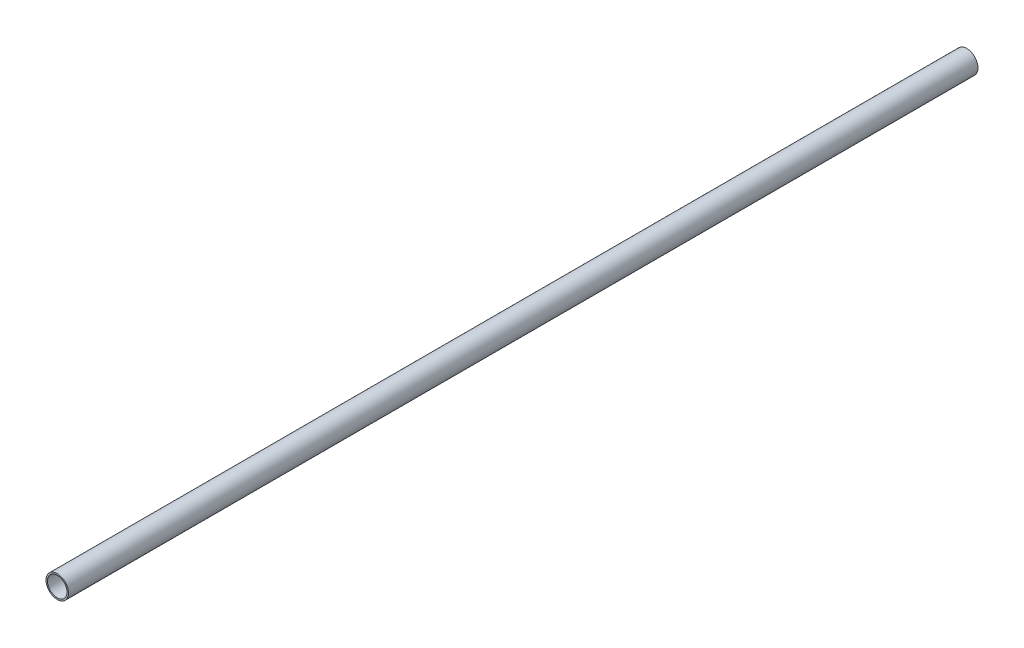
ISO-10303-21;
HEADER;
FILE_DESCRIPTION(('STEP AP214'),'2;1');
FILE_NAME('part.step','',(''),(''),'','','');
FILE_SCHEMA(('AUTOMOTIVE_DESIGN { 1 0 10303 214 1 1 1 1 }'));
ENDSEC;
DATA;
#1=APPLICATION_CONTEXT('core data for automotive mechanical design processes');
#2=APPLICATION_PROTOCOL_DEFINITION('international standard','automotive_design',2000,#1);
#3=PRODUCT_CONTEXT('',#1,'mechanical');
#4=PRODUCT('Part','Part','',(#3));
#5=PRODUCT_RELATED_PRODUCT_CATEGORY('part','',(#4));
#6=PRODUCT_DEFINITION_FORMATION('','',#4);
#7=PRODUCT_DEFINITION_CONTEXT('part definition',#1,'design');
#8=PRODUCT_DEFINITION('design','',#6,#7);
#9=PRODUCT_DEFINITION_SHAPE('','',#8);
#10=(LENGTH_UNIT() NAMED_UNIT(*) SI_UNIT(.MILLI.,.METRE.));
#11=(NAMED_UNIT(*) PLANE_ANGLE_UNIT() SI_UNIT($,.RADIAN.));
#12=(NAMED_UNIT(*) SI_UNIT($,.STERADIAN.) SOLID_ANGLE_UNIT());
#13=UNCERTAINTY_MEASURE_WITH_UNIT(LENGTH_MEASURE(1.E-05),#10,'distance_accuracy_value','');
#14=(GEOMETRIC_REPRESENTATION_CONTEXT(3) GLOBAL_UNCERTAINTY_ASSIGNED_CONTEXT((#13)) GLOBAL_UNIT_ASSIGNED_CONTEXT((#10,
#11,#12)) REPRESENTATION_CONTEXT('',''));
#15=CARTESIAN_POINT('',(0.,0.,0.));
#16=DIRECTION('',(0.,0.,1.));
#17=DIRECTION('',(1.,0.,0.));
#18=AXIS2_PLACEMENT_3D('',#15,#16,#17);
#19=CARTESIAN_POINT('',(0.,0.,2438.4));
#20=DIRECTION('',(0.,0.,1.));
#21=DIRECTION('',(1.,0.,0.));
#22=AXIS2_PLACEMENT_3D('',#19,#20,#21);
#23=PLANE('',#22);
#24=CARTESIAN_POINT('',(0.,0.,2438.4));
#25=DIRECTION('',(0.,0.,1.));
#26=DIRECTION('',(1.,0.,0.));
#27=AXIS2_PLACEMENT_3D('',#24,#25,#26);
#28=CIRCLE('',#27,30.1625);
#29=CARTESIAN_POINT('',(-30.1625,0.,2438.4));
#30=VERTEX_POINT('',#29);
#31=EDGE_CURVE('E10',#30,#30,#28,.T.);
#32=ORIENTED_EDGE('',*,*,#31,.T.);
#33=EDGE_LOOP('',(#32));
#34=FACE_BOUND('',#33,.T.);
#35=CARTESIAN_POINT('',(0.,0.,2438.4));
#36=DIRECTION('',(0.,0.,1.));
#37=DIRECTION('',(1.,0.,0.));
#38=AXIS2_PLACEMENT_3D('',#35,#36,#37);
#39=CIRCLE('',#38,26.2509);
#40=CARTESIAN_POINT('',(-26.2509,0.,2438.4));
#41=VERTEX_POINT('',#40);
#42=EDGE_CURVE('E47',#41,#41,#39,.T.);
#43=ORIENTED_EDGE('',*,*,#42,.F.);
#44=EDGE_LOOP('',(#43));
#45=FACE_BOUND('',#44,.T.);
#46=ADVANCED_FACE('F36',(#34,#45),#23,.T.);
#47=CARTESIAN_POINT('',(0.,0.,0.));
#48=DIRECTION('',(0.,0.,1.));
#49=DIRECTION('',(1.,0.,0.));
#50=AXIS2_PLACEMENT_3D('',#47,#48,#49);
#51=PLANE('',#50);
#52=CARTESIAN_POINT('',(0.,0.,0.));
#53=DIRECTION('',(0.,0.,1.));
#54=DIRECTION('',(1.,0.,0.));
#55=AXIS2_PLACEMENT_3D('',#52,#53,#54);
#56=CIRCLE('',#55,30.1625);
#57=CARTESIAN_POINT('',(-30.1625,0.,0.));
#58=VERTEX_POINT('',#57);
#59=EDGE_CURVE('E43',#58,#58,#56,.T.);
#60=ORIENTED_EDGE('',*,*,#59,.F.);
#61=EDGE_LOOP('',(#60));
#62=FACE_BOUND('',#61,.T.);
#63=CARTESIAN_POINT('',(0.,0.,0.));
#64=DIRECTION('',(0.,0.,1.));
#65=DIRECTION('',(1.,0.,0.));
#66=AXIS2_PLACEMENT_3D('',#63,#64,#65);
#67=CIRCLE('',#66,26.2509);
#68=CARTESIAN_POINT('',(-26.2509,0.,0.));
#69=VERTEX_POINT('',#68);
#70=EDGE_CURVE('E51',#69,#69,#67,.T.);
#71=ORIENTED_EDGE('',*,*,#70,.T.);
#72=EDGE_LOOP('',(#71));
#73=FACE_BOUND('',#72,.T.);
#74=ADVANCED_FACE('F57',(#62,#73),#51,.F.);
#75=CARTESIAN_POINT('',(0.,0.,2438.4));
#76=DIRECTION('',(0.,0.,-1.));
#77=DIRECTION('',(-1.,0.,0.));
#78=AXIS2_PLACEMENT_3D('',#75,#76,#77);
#79=CYLINDRICAL_SURFACE('',#78,30.1625);
#80=CARTESIAN_POINT('',(-30.1625,0.,2438.4));
#81=CARTESIAN_POINT('',(-30.1625,0.,2413.));
#82=CARTESIAN_POINT('',(-30.1625,0.,2387.6));
#83=CARTESIAN_POINT('',(-30.1625,0.,2336.8));
#84=CARTESIAN_POINT('',(-30.1625,0.,2311.4));
#85=CARTESIAN_POINT('',(-30.1625,0.,2260.6));
#86=CARTESIAN_POINT('',(-30.1625,0.,2235.2));
#87=CARTESIAN_POINT('',(-30.1625,0.,2184.4));
#88=CARTESIAN_POINT('',(-30.1625,0.,2159.));
#89=CARTESIAN_POINT('',(-30.1625,0.,2108.2));
#90=CARTESIAN_POINT('',(-30.1625,0.,2082.8));
#91=CARTESIAN_POINT('',(-30.1625,0.,2032.));
#92=CARTESIAN_POINT('',(-30.1625,0.,2006.6));
#93=CARTESIAN_POINT('',(-30.1625,0.,1955.8));
#94=CARTESIAN_POINT('',(-30.1625,0.,1930.4));
#95=CARTESIAN_POINT('',(-30.1625,0.,1879.6));
#96=CARTESIAN_POINT('',(-30.1625,0.,1854.2));
#97=CARTESIAN_POINT('',(-30.1625,0.,1803.4));
#98=CARTESIAN_POINT('',(-30.1625,0.,1778.));
#99=CARTESIAN_POINT('',(-30.1625,0.,1727.2));
#100=CARTESIAN_POINT('',(-30.1625,0.,1701.8));
#101=CARTESIAN_POINT('',(-30.1625,0.,1651.));
#102=CARTESIAN_POINT('',(-30.1625,0.,1625.6));
#103=CARTESIAN_POINT('',(-30.1625,0.,1574.8));
#104=CARTESIAN_POINT('',(-30.1625,0.,1549.4));
#105=CARTESIAN_POINT('',(-30.1625,0.,1498.6));
#106=CARTESIAN_POINT('',(-30.1625,0.,1473.2));
#107=CARTESIAN_POINT('',(-30.1625,0.,1422.4));
#108=CARTESIAN_POINT('',(-30.1625,0.,1397.));
#109=CARTESIAN_POINT('',(-30.1625,0.,1346.2));
#110=CARTESIAN_POINT('',(-30.1625,0.,1320.8));
#111=CARTESIAN_POINT('',(-30.1625,0.,1270.));
#112=CARTESIAN_POINT('',(-30.1625,0.,1244.6));
#113=CARTESIAN_POINT('',(-30.1625,0.,1193.8));
#114=CARTESIAN_POINT('',(-30.1625,0.,1168.4));
#115=CARTESIAN_POINT('',(-30.1625,0.,1117.6));
#116=CARTESIAN_POINT('',(-30.1625,0.,1092.2));
#117=CARTESIAN_POINT('',(-30.1625,0.,1041.4));
#118=CARTESIAN_POINT('',(-30.1625,0.,1016.));
#119=CARTESIAN_POINT('',(-30.1625,0.,965.2));
#120=CARTESIAN_POINT('',(-30.1625,0.,939.8));
#121=CARTESIAN_POINT('',(-30.1625,0.,889.));
#122=CARTESIAN_POINT('',(-30.1625,0.,863.6));
#123=CARTESIAN_POINT('',(-30.1625,0.,812.8));
#124=CARTESIAN_POINT('',(-30.1625,0.,787.4));
#125=CARTESIAN_POINT('',(-30.1625,0.,736.6));
#126=CARTESIAN_POINT('',(-30.1625,0.,711.2));
#127=CARTESIAN_POINT('',(-30.1625,0.,660.4));
#128=CARTESIAN_POINT('',(-30.1625,0.,635.));
#129=CARTESIAN_POINT('',(-30.1625,0.,584.2));
#130=CARTESIAN_POINT('',(-30.1625,0.,558.8));
#131=CARTESIAN_POINT('',(-30.1625,0.,508.));
#132=CARTESIAN_POINT('',(-30.1625,0.,482.6));
#133=CARTESIAN_POINT('',(-30.1625,0.,431.8));
#134=CARTESIAN_POINT('',(-30.1625,0.,406.4));
#135=CARTESIAN_POINT('',(-30.1625,0.,355.6));
#136=CARTESIAN_POINT('',(-30.1625,0.,330.2));
#137=CARTESIAN_POINT('',(-30.1625,0.,279.4));
#138=CARTESIAN_POINT('',(-30.1625,0.,254.));
#139=CARTESIAN_POINT('',(-30.1625,0.,203.2));
#140=CARTESIAN_POINT('',(-30.1625,0.,177.8));
#141=CARTESIAN_POINT('',(-30.1625,0.,127.));
#142=CARTESIAN_POINT('',(-30.1625,0.,101.6));
#143=CARTESIAN_POINT('',(-30.1625,0.,50.8));
#144=CARTESIAN_POINT('',(-30.1625,0.,25.4));
#145=CARTESIAN_POINT('',(-30.1625,0.,0.));
#146=B_SPLINE_CURVE_WITH_KNOTS('',3,(#80,#81,#82,#83,#84,#85,#86,#87,#88,#89,#90,#91,#92,#93,
#94,#95,#96,#97,#98,#99,#100,#101,#102,#103,#104,#105,#106,#107,#108,#109,#110,#111,#112,#113,
#114,#115,#116,#117,#118,#119,#120,#121,#122,#123,#124,#125,#126,#127,#128,#129,#130,#131,#132,
#133,#134,#135,#136,#137,#138,#139,#140,#141,#142,#143,#144,#145),.UNSPECIFIED.,.F.,.F.,(4,2,2,
2,2,2,2,2,2,2,2,2,2,2,2,2,2,2,2,2,2,2,2,2,2,2,2,2,2,2,2,2,4),(0.,76.2,152.4,228.6,304.8,381.,
457.2,533.4,609.6,685.8,762.,838.2,914.4,990.6,1066.8,1143.,1219.2,1295.4,1371.6,1447.8,1524.,
1600.2,1676.4,1752.6,1828.8,1905.,1981.2,2057.4,2133.6,2209.8,2286.,2362.2,2438.4),.UNSPECIFIED.);
#147=EDGE_CURVE('BSEAM38',#30,#58,#146,.T.);
#148=ORIENTED_EDGE('',*,*,#31,.F.);
#149=ORIENTED_EDGE('',*,*,#59,.T.);
#150=ORIENTED_EDGE('',*,*,#147,.T.);
#151=ORIENTED_EDGE('',*,*,#147,.F.);
#152=EDGE_LOOP('',(#148,#150,#149,#151));
#153=FACE_BOUND('',#152,.T.);
#154=ADVANCED_FACE('F38',(#153),#79,.T.);
#155=CARTESIAN_POINT('',(0.,0.,2438.4));
#156=DIRECTION('',(0.,0.,-1.));
#157=DIRECTION('',(-1.,0.,0.));
#158=AXIS2_PLACEMENT_3D('',#155,#156,#157);
#159=CYLINDRICAL_SURFACE('',#158,26.2509);
#160=CARTESIAN_POINT('',(-26.2509,0.,2438.4));
#161=CARTESIAN_POINT('',(-26.2509,0.,2413.));
#162=CARTESIAN_POINT('',(-26.2509,0.,2387.6));
#163=CARTESIAN_POINT('',(-26.2509,0.,2336.8));
#164=CARTESIAN_POINT('',(-26.2509,0.,2311.4));
#165=CARTESIAN_POINT('',(-26.2509,0.,2260.6));
#166=CARTESIAN_POINT('',(-26.2509,0.,2235.2));
#167=CARTESIAN_POINT('',(-26.2509,0.,2184.4));
#168=CARTESIAN_POINT('',(-26.2509,0.,2159.));
#169=CARTESIAN_POINT('',(-26.2509,0.,2108.2));
#170=CARTESIAN_POINT('',(-26.2509,0.,2082.8));
#171=CARTESIAN_POINT('',(-26.2509,0.,2032.));
#172=CARTESIAN_POINT('',(-26.2509,0.,2006.6));
#173=CARTESIAN_POINT('',(-26.2509,0.,1955.8));
#174=CARTESIAN_POINT('',(-26.2509,0.,1930.4));
#175=CARTESIAN_POINT('',(-26.2509,0.,1879.6));
#176=CARTESIAN_POINT('',(-26.2509,0.,1854.2));
#177=CARTESIAN_POINT('',(-26.2509,0.,1803.4));
#178=CARTESIAN_POINT('',(-26.2509,0.,1778.));
#179=CARTESIAN_POINT('',(-26.2509,0.,1727.2));
#180=CARTESIAN_POINT('',(-26.2509,0.,1701.8));
#181=CARTESIAN_POINT('',(-26.2509,0.,1651.));
#182=CARTESIAN_POINT('',(-26.2509,0.,1625.6));
#183=CARTESIAN_POINT('',(-26.2509,0.,1574.8));
#184=CARTESIAN_POINT('',(-26.2509,0.,1549.4));
#185=CARTESIAN_POINT('',(-26.2509,0.,1498.6));
#186=CARTESIAN_POINT('',(-26.2509,0.,1473.2));
#187=CARTESIAN_POINT('',(-26.2509,0.,1422.4));
#188=CARTESIAN_POINT('',(-26.2509,0.,1397.));
#189=CARTESIAN_POINT('',(-26.2509,0.,1346.2));
#190=CARTESIAN_POINT('',(-26.2509,0.,1320.8));
#191=CARTESIAN_POINT('',(-26.2509,0.,1270.));
#192=CARTESIAN_POINT('',(-26.2509,0.,1244.6));
#193=CARTESIAN_POINT('',(-26.2509,0.,1193.8));
#194=CARTESIAN_POINT('',(-26.2509,0.,1168.4));
#195=CARTESIAN_POINT('',(-26.2509,0.,1117.6));
#196=CARTESIAN_POINT('',(-26.2509,0.,1092.2));
#197=CARTESIAN_POINT('',(-26.2509,0.,1041.4));
#198=CARTESIAN_POINT('',(-26.2509,0.,1016.));
#199=CARTESIAN_POINT('',(-26.2509,0.,965.2));
#200=CARTESIAN_POINT('',(-26.2509,0.,939.8));
#201=CARTESIAN_POINT('',(-26.2509,0.,889.));
#202=CARTESIAN_POINT('',(-26.2509,0.,863.6));
#203=CARTESIAN_POINT('',(-26.2509,0.,812.8));
#204=CARTESIAN_POINT('',(-26.2509,0.,787.4));
#205=CARTESIAN_POINT('',(-26.2509,0.,736.6));
#206=CARTESIAN_POINT('',(-26.2509,0.,711.2));
#207=CARTESIAN_POINT('',(-26.2509,0.,660.4));
#208=CARTESIAN_POINT('',(-26.2509,0.,635.));
#209=CARTESIAN_POINT('',(-26.2509,0.,584.2));
#210=CARTESIAN_POINT('',(-26.2509,0.,558.8));
#211=CARTESIAN_POINT('',(-26.2509,0.,508.));
#212=CARTESIAN_POINT('',(-26.2509,0.,482.6));
#213=CARTESIAN_POINT('',(-26.2509,0.,431.8));
#214=CARTESIAN_POINT('',(-26.2509,0.,406.4));
#215=CARTESIAN_POINT('',(-26.2509,0.,355.6));
#216=CARTESIAN_POINT('',(-26.2509,0.,330.2));
#217=CARTESIAN_POINT('',(-26.2509,0.,279.4));
#218=CARTESIAN_POINT('',(-26.2509,0.,254.));
#219=CARTESIAN_POINT('',(-26.2509,0.,203.2));
#220=CARTESIAN_POINT('',(-26.2509,0.,177.8));
#221=CARTESIAN_POINT('',(-26.2509,0.,127.));
#222=CARTESIAN_POINT('',(-26.2509,0.,101.6));
#223=CARTESIAN_POINT('',(-26.2509,0.,50.8));
#224=CARTESIAN_POINT('',(-26.2509,0.,25.4));
#225=CARTESIAN_POINT('',(-26.2509,0.,0.));
#226=B_SPLINE_CURVE_WITH_KNOTS('',3,(#160,#161,#162,#163,#164,#165,#166,#167,#168,#169,#170,
#171,#172,#173,#174,#175,#176,#177,#178,#179,#180,#181,#182,#183,#184,#185,#186,#187,#188,#189,
#190,#191,#192,#193,#194,#195,#196,#197,#198,#199,#200,#201,#202,#203,#204,#205,#206,#207,#208,
#209,#210,#211,#212,#213,#214,#215,#216,#217,#218,#219,#220,#221,#222,#223,#224,#225),
.UNSPECIFIED.,.F.,.F.,(4,2,2,2,2,2,2,2,2,2,2,2,2,2,2,2,2,2,2,2,2,2,2,2,2,2,2,2,2,2,2,2,4),(0.,
76.1999999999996,152.4,228.6,304.8,381.,457.2,533.4,609.6,685.8,762.,838.2,914.4,990.6,1066.8,
1143.,1219.2,1295.4,1371.6,1447.8,1524.,1600.2,1676.4,1752.6,1828.8,1905.,1981.2,2057.4,2133.6,
2209.8,2286.,2362.2,2438.4),.UNSPECIFIED.);
#227=EDGE_CURVE('BSEAM59',#41,#69,#226,.T.);
#228=ORIENTED_EDGE('',*,*,#42,.T.);
#229=ORIENTED_EDGE('',*,*,#70,.F.);
#230=ORIENTED_EDGE('',*,*,#227,.T.);
#231=ORIENTED_EDGE('',*,*,#227,.F.);
#232=EDGE_LOOP('',(#228,#230,#229,#231));
#233=FACE_BOUND('',#232,.T.);
#234=ADVANCED_FACE('F59',(#233),#159,.F.);
#235=CLOSED_SHELL('',(#46,#74,#154,#234));
#236=MANIFOLD_SOLID_BREP('B2',#235);
#237=ADVANCED_BREP_SHAPE_REPRESENTATION('',(#18,#236),#14);
#238=SHAPE_DEFINITION_REPRESENTATION(#9,#237);
ENDSEC;
END-ISO-10303-21;
